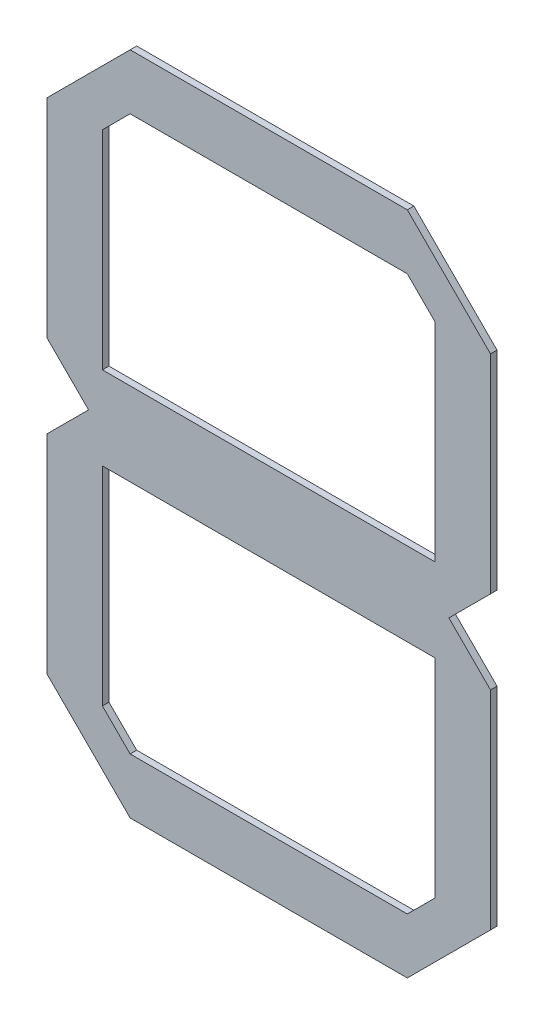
ISO-10303-21;
HEADER;
FILE_DESCRIPTION(('STEP AP214'),'2;1');
FILE_NAME('part.step','',(''),(''),'','','');
FILE_SCHEMA(('AUTOMOTIVE_DESIGN { 1 0 10303 214 1 1 1 1 }'));
ENDSEC;
DATA;
#1=APPLICATION_CONTEXT('core data for automotive mechanical design processes');
#2=APPLICATION_PROTOCOL_DEFINITION('international standard','automotive_design',2000,#1);
#3=PRODUCT_CONTEXT('',#1,'mechanical');
#4=PRODUCT('Part','Part','',(#3));
#5=PRODUCT_RELATED_PRODUCT_CATEGORY('part','',(#4));
#6=PRODUCT_DEFINITION_FORMATION('','',#4);
#7=PRODUCT_DEFINITION_CONTEXT('part definition',#1,'design');
#8=PRODUCT_DEFINITION('design','',#6,#7);
#9=PRODUCT_DEFINITION_SHAPE('','',#8);
#10=(LENGTH_UNIT() NAMED_UNIT(*) SI_UNIT(.MILLI.,.METRE.));
#11=(NAMED_UNIT(*) PLANE_ANGLE_UNIT() SI_UNIT($,.RADIAN.));
#12=(NAMED_UNIT(*) SI_UNIT($,.STERADIAN.) SOLID_ANGLE_UNIT());
#13=UNCERTAINTY_MEASURE_WITH_UNIT(LENGTH_MEASURE(1.E-05),#10,'distance_accuracy_value','');
#14=(GEOMETRIC_REPRESENTATION_CONTEXT(3) GLOBAL_UNCERTAINTY_ASSIGNED_CONTEXT((#13)) GLOBAL_UNIT_ASSIGNED_CONTEXT((#10,
#11,#12)) REPRESENTATION_CONTEXT('',''));
#15=CARTESIAN_POINT('',(0.,0.,0.));
#16=DIRECTION('',(0.,0.,1.));
#17=DIRECTION('',(1.,0.,0.));
#18=AXIS2_PLACEMENT_3D('',#15,#16,#17);
#19=CARTESIAN_POINT('',(203.2,228.6,-6.));
#20=DIRECTION('',(0.707106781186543,0.707106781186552,0.));
#21=DIRECTION('',(-0.707106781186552,0.707106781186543,0.));
#22=AXIS2_PLACEMENT_3D('',#19,#20,#21);
#23=PLANE('',#22);
#24=DIRECTION('',(-0.707106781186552,0.707106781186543,0.));
#25=VECTOR('',#24,1.);
#26=CARTESIAN_POINT('',(203.2,228.6,0.));
#27=LINE('',#26,#25);
#28=CARTESIAN_POINT('',(203.2,228.6,0.));
#29=VERTEX_POINT('',#28);
#30=CARTESIAN_POINT('',(126.999999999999,304.8,0.));
#31=VERTEX_POINT('',#30);
#32=EDGE_CURVE('E297',#29,#31,#27,.T.);
#33=ORIENTED_EDGE('',*,*,#32,.F.);
#34=DIRECTION('',(0.,0.,1.));
#35=VECTOR('',#34,1.);
#36=CARTESIAN_POINT('',(203.2,228.6,-6.));
#37=LINE('',#36,#35);
#38=CARTESIAN_POINT('',(203.2,228.6,-6.));
#39=VERTEX_POINT('',#38);
#40=EDGE_CURVE('E11',#39,#29,#37,.T.);
#41=ORIENTED_EDGE('',*,*,#40,.F.);
#42=DIRECTION('',(-0.707106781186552,0.707106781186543,0.));
#43=VECTOR('',#42,1.);
#44=CARTESIAN_POINT('',(203.2,228.6,-6.));
#45=LINE('',#44,#43);
#46=CARTESIAN_POINT('',(126.999999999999,304.8,-6.));
#47=VERTEX_POINT('',#46);
#48=EDGE_CURVE('E307',#39,#47,#45,.T.);
#49=ORIENTED_EDGE('',*,*,#48,.T.);
#50=DIRECTION('',(0.,0.,1.));
#51=VECTOR('',#50,1.);
#52=CARTESIAN_POINT('',(126.999999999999,304.8,-6.));
#53=LINE('',#52,#51);
#54=EDGE_CURVE('E36',#47,#31,#53,.T.);
#55=ORIENTED_EDGE('',*,*,#54,.T.);
#56=EDGE_LOOP('',(#33,#41,#49,#55));
#57=FACE_BOUND('',#56,.T.);
#58=ADVANCED_FACE('F33',(#57),#23,.T.);
#59=CARTESIAN_POINT('',(203.2,228.6,-6.));
#60=DIRECTION('',(1.,0.,0.));
#61=DIRECTION('',(0.,1.,0.));
#62=AXIS2_PLACEMENT_3D('',#59,#60,#61);
#63=PLANE('',#62);
#64=DIRECTION('',(0.,1.,0.));
#65=VECTOR('',#64,1.);
#66=CARTESIAN_POINT('',(203.2,228.6,0.));
#67=LINE('',#66,#65);
#68=CARTESIAN_POINT('',(203.2,38.1000000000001,0.));
#69=VERTEX_POINT('',#68);
#70=EDGE_CURVE('E311',#69,#29,#67,.T.);
#71=ORIENTED_EDGE('',*,*,#70,.F.);
#72=DIRECTION('',(0.,0.,1.));
#73=VECTOR('',#72,1.);
#74=CARTESIAN_POINT('',(203.2,38.1000000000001,-6.));
#75=LINE('',#74,#73);
#76=CARTESIAN_POINT('',(203.2,38.1000000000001,-6.));
#77=VERTEX_POINT('',#76);
#78=EDGE_CURVE('E41',#77,#69,#75,.T.);
#79=ORIENTED_EDGE('',*,*,#78,.F.);
#80=DIRECTION('',(0.,1.,0.));
#81=VECTOR('',#80,1.);
#82=CARTESIAN_POINT('',(203.2,228.6,-6.));
#83=LINE('',#82,#81);
#84=EDGE_CURVE('E347',#77,#39,#83,.T.);
#85=ORIENTED_EDGE('',*,*,#84,.T.);
#86=ORIENTED_EDGE('',*,*,#40,.T.);
#87=EDGE_LOOP('',(#71,#79,#85,#86));
#88=FACE_BOUND('',#87,.T.);
#89=ADVANCED_FACE('F424',(#88),#63,.T.);
#90=CARTESIAN_POINT('',(165.1,2.22044604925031E-13,-6.));
#91=DIRECTION('',(0.707106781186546,-0.707106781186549,0.));
#92=DIRECTION('',(0.707106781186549,0.707106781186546,0.));
#93=AXIS2_PLACEMENT_3D('',#90,#91,#92);
#94=PLANE('',#93);
#95=DIRECTION('',(0.707106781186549,0.707106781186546,0.));
#96=VECTOR('',#95,1.);
#97=CARTESIAN_POINT('',(165.1,2.22044604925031E-13,0.));
#98=LINE('',#97,#96);
#99=CARTESIAN_POINT('',(165.1,2.22044604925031E-13,0.));
#100=VERTEX_POINT('',#99);
#101=EDGE_CURVE('E385',#100,#69,#98,.T.);
#102=ORIENTED_EDGE('',*,*,#101,.F.);
#103=DIRECTION('',(0.,0.,1.));
#104=VECTOR('',#103,1.);
#105=CARTESIAN_POINT('',(165.1,2.22044604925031E-13,-6.));
#106=LINE('',#105,#104);
#107=CARTESIAN_POINT('',(165.1,2.22044604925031E-13,-6.));
#108=VERTEX_POINT('',#107);
#109=EDGE_CURVE('E391',#108,#100,#106,.T.);
#110=ORIENTED_EDGE('',*,*,#109,.F.);
#111=DIRECTION('',(0.707106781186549,0.707106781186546,0.));
#112=VECTOR('',#111,1.);
#113=CARTESIAN_POINT('',(165.1,2.22044604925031E-13,-6.));
#114=LINE('',#113,#112);
#115=EDGE_CURVE('E344',#108,#77,#114,.T.);
#116=ORIENTED_EDGE('',*,*,#115,.T.);
#117=ORIENTED_EDGE('',*,*,#78,.T.);
#118=EDGE_LOOP('',(#102,#110,#116,#117));
#119=FACE_BOUND('',#118,.T.);
#120=ADVANCED_FACE('F468',(#119),#94,.T.);
#121=CARTESIAN_POINT('',(165.1,2.22044604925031E-13,-6.));
#122=DIRECTION('',(0.707106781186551,0.707106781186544,0.));
#123=DIRECTION('',(-0.707106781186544,0.707106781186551,0.));
#124=AXIS2_PLACEMENT_3D('',#121,#122,#123);
#125=PLANE('',#124);
#126=DIRECTION('',(-0.707106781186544,0.707106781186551,0.));
#127=VECTOR('',#126,1.);
#128=CARTESIAN_POINT('',(165.1,2.22044604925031E-13,0.));
#129=LINE('',#128,#127);
#130=CARTESIAN_POINT('',(203.2,-38.1000000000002,0.));
#131=VERTEX_POINT('',#130);
#132=EDGE_CURVE('E382',#131,#100,#129,.T.);
#133=ORIENTED_EDGE('',*,*,#132,.F.);
#134=DIRECTION('',(0.,0.,1.));
#135=VECTOR('',#134,1.);
#136=CARTESIAN_POINT('',(203.2,-38.1000000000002,-6.));
#137=LINE('',#136,#135);
#138=CARTESIAN_POINT('',(203.2,-38.1000000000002,-6.));
#139=VERTEX_POINT('',#138);
#140=EDGE_CURVE('E393',#139,#131,#137,.T.);
#141=ORIENTED_EDGE('',*,*,#140,.F.);
#142=DIRECTION('',(-0.707106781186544,0.707106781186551,0.));
#143=VECTOR('',#142,1.);
#144=CARTESIAN_POINT('',(165.1,2.22044604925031E-13,-6.));
#145=LINE('',#144,#143);
#146=EDGE_CURVE('E341',#139,#108,#145,.T.);
#147=ORIENTED_EDGE('',*,*,#146,.T.);
#148=ORIENTED_EDGE('',*,*,#109,.T.);
#149=EDGE_LOOP('',(#133,#141,#147,#148));
#150=FACE_BOUND('',#149,.T.);
#151=ADVANCED_FACE('F466',(#150),#125,.T.);
#152=CARTESIAN_POINT('',(203.2,-38.1000000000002,-6.));
#153=DIRECTION('',(1.,0.,0.));
#154=DIRECTION('',(0.,1.,0.));
#155=AXIS2_PLACEMENT_3D('',#152,#153,#154);
#156=PLANE('',#155);
#157=DIRECTION('',(0.,1.,0.));
#158=VECTOR('',#157,1.);
#159=CARTESIAN_POINT('',(203.2,-38.1000000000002,0.));
#160=LINE('',#159,#158);
#161=CARTESIAN_POINT('',(203.2,-228.6,0.));
#162=VERTEX_POINT('',#161);
#163=EDGE_CURVE('E379',#162,#131,#160,.T.);
#164=ORIENTED_EDGE('',*,*,#163,.F.);
#165=DIRECTION('',(0.,0.,1.));
#166=VECTOR('',#165,1.);
#167=CARTESIAN_POINT('',(203.2,-228.6,-6.));
#168=LINE('',#167,#166);
#169=CARTESIAN_POINT('',(203.2,-228.6,-6.));
#170=VERTEX_POINT('',#169);
#171=EDGE_CURVE('E395',#170,#162,#168,.T.);
#172=ORIENTED_EDGE('',*,*,#171,.F.);
#173=DIRECTION('',(0.,1.,0.));
#174=VECTOR('',#173,1.);
#175=CARTESIAN_POINT('',(203.2,-38.1000000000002,-6.));
#176=LINE('',#175,#174);
#177=EDGE_CURVE('E338',#170,#139,#176,.T.);
#178=ORIENTED_EDGE('',*,*,#177,.T.);
#179=ORIENTED_EDGE('',*,*,#140,.T.);
#180=EDGE_LOOP('',(#164,#172,#178,#179));
#181=FACE_BOUND('',#180,.T.);
#182=ADVANCED_FACE('F462',(#181),#156,.T.);
#183=CARTESIAN_POINT('',(203.2,-228.6,-6.));
#184=DIRECTION('',(0.707106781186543,-0.707106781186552,0.));
#185=DIRECTION('',(0.707106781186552,0.707106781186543,0.));
#186=AXIS2_PLACEMENT_3D('',#183,#184,#185);
#187=PLANE('',#186);
#188=DIRECTION('',(0.707106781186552,0.707106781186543,0.));
#189=VECTOR('',#188,1.);
#190=CARTESIAN_POINT('',(203.2,-228.6,0.));
#191=LINE('',#190,#189);
#192=CARTESIAN_POINT('',(126.999999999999,-304.8,0.));
#193=VERTEX_POINT('',#192);
#194=EDGE_CURVE('E376',#193,#162,#191,.T.);
#195=ORIENTED_EDGE('',*,*,#194,.F.);
#196=DIRECTION('',(0.,0.,1.));
#197=VECTOR('',#196,1.);
#198=CARTESIAN_POINT('',(126.999999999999,-304.8,-6.));
#199=LINE('',#198,#197);
#200=CARTESIAN_POINT('',(126.999999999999,-304.8,-6.));
#201=VERTEX_POINT('',#200);
#202=EDGE_CURVE('E397',#201,#193,#199,.T.);
#203=ORIENTED_EDGE('',*,*,#202,.F.);
#204=DIRECTION('',(0.707106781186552,0.707106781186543,0.));
#205=VECTOR('',#204,1.);
#206=CARTESIAN_POINT('',(203.2,-228.6,-6.));
#207=LINE('',#206,#205);
#208=EDGE_CURVE('E335',#201,#170,#207,.T.);
#209=ORIENTED_EDGE('',*,*,#208,.T.);
#210=ORIENTED_EDGE('',*,*,#171,.T.);
#211=EDGE_LOOP('',(#195,#203,#209,#210));
#212=FACE_BOUND('',#211,.T.);
#213=ADVANCED_FACE('F458',(#212),#187,.T.);
#214=CARTESIAN_POINT('',(126.999999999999,-304.8,-6.));
#215=DIRECTION('',(0.,-1.,0.));
#216=DIRECTION('',(1.,0.,0.));
#217=AXIS2_PLACEMENT_3D('',#214,#215,#216);
#218=PLANE('',#217);
#219=DIRECTION('',(1.,0.,0.));
#220=VECTOR('',#219,1.);
#221=CARTESIAN_POINT('',(126.999999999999,-304.8,0.));
#222=LINE('',#221,#220);
#223=CARTESIAN_POINT('',(-126.999999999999,-304.8,0.));
#224=VERTEX_POINT('',#223);
#225=EDGE_CURVE('E373',#224,#193,#222,.T.);
#226=ORIENTED_EDGE('',*,*,#225,.F.);
#227=DIRECTION('',(0.,0.,1.));
#228=VECTOR('',#227,1.);
#229=CARTESIAN_POINT('',(-126.999999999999,-304.8,-6.));
#230=LINE('',#229,#228);
#231=CARTESIAN_POINT('',(-126.999999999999,-304.8,-6.));
#232=VERTEX_POINT('',#231);
#233=EDGE_CURVE('E399',#232,#224,#230,.T.);
#234=ORIENTED_EDGE('',*,*,#233,.F.);
#235=DIRECTION('',(1.,0.,0.));
#236=VECTOR('',#235,1.);
#237=CARTESIAN_POINT('',(126.999999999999,-304.8,-6.));
#238=LINE('',#237,#236);
#239=EDGE_CURVE('E332',#232,#201,#238,.T.);
#240=ORIENTED_EDGE('',*,*,#239,.T.);
#241=ORIENTED_EDGE('',*,*,#202,.T.);
#242=EDGE_LOOP('',(#226,#234,#240,#241));
#243=FACE_BOUND('',#242,.T.);
#244=ADVANCED_FACE('F454',(#243),#218,.T.);
#245=CARTESIAN_POINT('',(-203.2,-228.6,-6.));
#246=DIRECTION('',(-0.707106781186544,-0.707106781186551,0.));
#247=DIRECTION('',(0.707106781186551,-0.707106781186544,0.));
#248=AXIS2_PLACEMENT_3D('',#245,#246,#247);
#249=PLANE('',#248);
#250=DIRECTION('',(0.707106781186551,-0.707106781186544,0.));
#251=VECTOR('',#250,1.);
#252=CARTESIAN_POINT('',(-203.2,-228.6,0.));
#253=LINE('',#252,#251);
#254=CARTESIAN_POINT('',(-203.2,-228.6,0.));
#255=VERTEX_POINT('',#254);
#256=EDGE_CURVE('E370',#255,#224,#253,.T.);
#257=ORIENTED_EDGE('',*,*,#256,.F.);
#258=DIRECTION('',(0.,0.,1.));
#259=VECTOR('',#258,1.);
#260=CARTESIAN_POINT('',(-203.2,-228.6,-6.));
#261=LINE('',#260,#259);
#262=CARTESIAN_POINT('',(-203.2,-228.6,-6.));
#263=VERTEX_POINT('',#262);
#264=EDGE_CURVE('E401',#263,#255,#261,.T.);
#265=ORIENTED_EDGE('',*,*,#264,.F.);
#266=DIRECTION('',(0.707106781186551,-0.707106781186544,0.));
#267=VECTOR('',#266,1.);
#268=CARTESIAN_POINT('',(-203.2,-228.6,-6.));
#269=LINE('',#268,#267);
#270=EDGE_CURVE('E329',#263,#232,#269,.T.);
#271=ORIENTED_EDGE('',*,*,#270,.T.);
#272=ORIENTED_EDGE('',*,*,#233,.T.);
#273=EDGE_LOOP('',(#257,#265,#271,#272));
#274=FACE_BOUND('',#273,.T.);
#275=ADVANCED_FACE('F450',(#274),#249,.T.);
#276=CARTESIAN_POINT('',(-203.2,-228.6,-6.));
#277=DIRECTION('',(-1.,0.,0.));
#278=DIRECTION('',(0.,-1.,0.));
#279=AXIS2_PLACEMENT_3D('',#276,#277,#278);
#280=PLANE('',#279);
#281=DIRECTION('',(0.,-1.,0.));
#282=VECTOR('',#281,1.);
#283=CARTESIAN_POINT('',(-203.2,-228.6,0.));
#284=LINE('',#283,#282);
#285=CARTESIAN_POINT('',(-203.2,-38.1000000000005,0.));
#286=VERTEX_POINT('',#285);
#287=EDGE_CURVE('E367',#286,#255,#284,.T.);
#288=ORIENTED_EDGE('',*,*,#287,.F.);
#289=DIRECTION('',(0.,0.,1.));
#290=VECTOR('',#289,1.);
#291=CARTESIAN_POINT('',(-203.2,-38.1000000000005,-6.));
#292=LINE('',#291,#290);
#293=CARTESIAN_POINT('',(-203.2,-38.1000000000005,-6.));
#294=VERTEX_POINT('',#293);
#295=EDGE_CURVE('E403',#294,#286,#292,.T.);
#296=ORIENTED_EDGE('',*,*,#295,.F.);
#297=DIRECTION('',(0.,-1.,0.));
#298=VECTOR('',#297,1.);
#299=CARTESIAN_POINT('',(-203.2,-228.6,-6.));
#300=LINE('',#299,#298);
#301=EDGE_CURVE('E326',#294,#263,#300,.T.);
#302=ORIENTED_EDGE('',*,*,#301,.T.);
#303=ORIENTED_EDGE('',*,*,#264,.T.);
#304=EDGE_LOOP('',(#288,#296,#302,#303));
#305=FACE_BOUND('',#304,.T.);
#306=ADVANCED_FACE('F446',(#305),#280,.T.);
#307=CARTESIAN_POINT('',(-165.1,0.,-6.));
#308=DIRECTION('',(-0.707106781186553,0.707106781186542,0.));
#309=DIRECTION('',(-0.707106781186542,-0.707106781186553,0.));
#310=AXIS2_PLACEMENT_3D('',#307,#308,#309);
#311=PLANE('',#310);
#312=DIRECTION('',(-0.707106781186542,-0.707106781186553,0.));
#313=VECTOR('',#312,1.);
#314=CARTESIAN_POINT('',(-165.1,0.,0.));
#315=LINE('',#314,#313);
#316=CARTESIAN_POINT('',(-165.1,0.,0.));
#317=VERTEX_POINT('',#316);
#318=EDGE_CURVE('E364',#317,#286,#315,.T.);
#319=ORIENTED_EDGE('',*,*,#318,.F.);
#320=DIRECTION('',(0.,0.,1.));
#321=VECTOR('',#320,1.);
#322=CARTESIAN_POINT('',(-165.1,0.,-6.));
#323=LINE('',#322,#321);
#324=CARTESIAN_POINT('',(-165.1,0.,-6.));
#325=VERTEX_POINT('',#324);
#326=EDGE_CURVE('E405',#325,#317,#323,.T.);
#327=ORIENTED_EDGE('',*,*,#326,.F.);
#328=DIRECTION('',(-0.707106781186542,-0.707106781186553,0.));
#329=VECTOR('',#328,1.);
#330=CARTESIAN_POINT('',(-165.1,0.,-6.));
#331=LINE('',#330,#329);
#332=EDGE_CURVE('E323',#325,#294,#331,.T.);
#333=ORIENTED_EDGE('',*,*,#332,.T.);
#334=ORIENTED_EDGE('',*,*,#295,.T.);
#335=EDGE_LOOP('',(#319,#327,#333,#334));
#336=FACE_BOUND('',#335,.T.);
#337=ADVANCED_FACE('F442',(#336),#311,.T.);
#338=CARTESIAN_POINT('',(-165.1,0.,-6.));
#339=DIRECTION('',(-0.707106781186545,-0.70710678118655,0.));
#340=DIRECTION('',(0.70710678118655,-0.707106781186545,0.));
#341=AXIS2_PLACEMENT_3D('',#338,#339,#340);
#342=PLANE('',#341);
#343=DIRECTION('',(0.70710678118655,-0.707106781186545,0.));
#344=VECTOR('',#343,1.);
#345=CARTESIAN_POINT('',(-165.1,0.,0.));
#346=LINE('',#345,#344);
#347=CARTESIAN_POINT('',(-203.2,38.0999999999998,0.));
#348=VERTEX_POINT('',#347);
#349=EDGE_CURVE('E361',#348,#317,#346,.T.);
#350=ORIENTED_EDGE('',*,*,#349,.F.);
#351=DIRECTION('',(0.,0.,1.));
#352=VECTOR('',#351,1.);
#353=CARTESIAN_POINT('',(-203.2,38.0999999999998,-6.));
#354=LINE('',#353,#352);
#355=CARTESIAN_POINT('',(-203.2,38.0999999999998,-6.));
#356=VERTEX_POINT('',#355);
#357=EDGE_CURVE('E407',#356,#348,#354,.T.);
#358=ORIENTED_EDGE('',*,*,#357,.F.);
#359=DIRECTION('',(0.70710678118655,-0.707106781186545,0.));
#360=VECTOR('',#359,1.);
#361=CARTESIAN_POINT('',(-165.1,0.,-6.));
#362=LINE('',#361,#360);
#363=EDGE_CURVE('E320',#356,#325,#362,.T.);
#364=ORIENTED_EDGE('',*,*,#363,.T.);
#365=ORIENTED_EDGE('',*,*,#326,.T.);
#366=EDGE_LOOP('',(#350,#358,#364,#365));
#367=FACE_BOUND('',#366,.T.);
#368=ADVANCED_FACE('F438',(#367),#342,.T.);
#369=CARTESIAN_POINT('',(-203.2,38.0999999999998,-6.));
#370=DIRECTION('',(-1.,0.,0.));
#371=DIRECTION('',(0.,-1.,0.));
#372=AXIS2_PLACEMENT_3D('',#369,#370,#371);
#373=PLANE('',#372);
#374=DIRECTION('',(0.,-1.,0.));
#375=VECTOR('',#374,1.);
#376=CARTESIAN_POINT('',(-203.2,38.0999999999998,0.));
#377=LINE('',#376,#375);
#378=CARTESIAN_POINT('',(-203.2,228.6,0.));
#379=VERTEX_POINT('',#378);
#380=EDGE_CURVE('E358',#379,#348,#377,.T.);
#381=ORIENTED_EDGE('',*,*,#380,.F.);
#382=DIRECTION('',(0.,0.,1.));
#383=VECTOR('',#382,1.);
#384=CARTESIAN_POINT('',(-203.2,228.6,-6.));
#385=LINE('',#384,#383);
#386=CARTESIAN_POINT('',(-203.2,228.6,-6.));
#387=VERTEX_POINT('',#386);
#388=EDGE_CURVE('E409',#387,#379,#385,.T.);
#389=ORIENTED_EDGE('',*,*,#388,.F.);
#390=DIRECTION('',(0.,-1.,0.));
#391=VECTOR('',#390,1.);
#392=CARTESIAN_POINT('',(-203.2,38.0999999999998,-6.));
#393=LINE('',#392,#391);
#394=EDGE_CURVE('E317',#387,#356,#393,.T.);
#395=ORIENTED_EDGE('',*,*,#394,.T.);
#396=ORIENTED_EDGE('',*,*,#357,.T.);
#397=EDGE_LOOP('',(#381,#389,#395,#396));
#398=FACE_BOUND('',#397,.T.);
#399=ADVANCED_FACE('F436',(#398),#373,.T.);
#400=CARTESIAN_POINT('',(-203.2,228.6,-6.));
#401=DIRECTION('',(-0.707106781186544,0.707106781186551,0.));
#402=DIRECTION('',(-0.707106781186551,-0.707106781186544,0.));
#403=AXIS2_PLACEMENT_3D('',#400,#401,#402);
#404=PLANE('',#403);
#405=DIRECTION('',(-0.707106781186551,-0.707106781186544,0.));
#406=VECTOR('',#405,1.);
#407=CARTESIAN_POINT('',(-203.2,228.6,0.));
#408=LINE('',#407,#406);
#409=CARTESIAN_POINT('',(-126.999999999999,304.8,0.));
#410=VERTEX_POINT('',#409);
#411=EDGE_CURVE('E355',#410,#379,#408,.T.);
#412=ORIENTED_EDGE('',*,*,#411,.F.);
#413=DIRECTION('',(0.,0.,1.));
#414=VECTOR('',#413,1.);
#415=CARTESIAN_POINT('',(-126.999999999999,304.8,-6.));
#416=LINE('',#415,#414);
#417=CARTESIAN_POINT('',(-126.999999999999,304.8,-6.));
#418=VERTEX_POINT('',#417);
#419=EDGE_CURVE('E410',#418,#410,#416,.T.);
#420=ORIENTED_EDGE('',*,*,#419,.F.);
#421=DIRECTION('',(-0.707106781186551,-0.707106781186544,0.));
#422=VECTOR('',#421,1.);
#423=CARTESIAN_POINT('',(-203.2,228.6,-6.));
#424=LINE('',#423,#422);
#425=EDGE_CURVE('E314',#418,#387,#424,.T.);
#426=ORIENTED_EDGE('',*,*,#425,.T.);
#427=ORIENTED_EDGE('',*,*,#388,.T.);
#428=EDGE_LOOP('',(#412,#420,#426,#427));
#429=FACE_BOUND('',#428,.T.);
#430=ADVANCED_FACE('F432',(#429),#404,.T.);
#431=CARTESIAN_POINT('',(-126.999999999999,304.8,-6.));
#432=DIRECTION('',(0.,1.,0.));
#433=DIRECTION('',(-1.,0.,0.));
#434=AXIS2_PLACEMENT_3D('',#431,#432,#433);
#435=PLANE('',#434);
#436=DIRECTION('',(-1.,0.,0.));
#437=VECTOR('',#436,1.);
#438=CARTESIAN_POINT('',(-126.999999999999,304.8,0.));
#439=LINE('',#438,#437);
#440=EDGE_CURVE('E352',#31,#410,#439,.T.);
#441=ORIENTED_EDGE('',*,*,#440,.F.);
#442=ORIENTED_EDGE('',*,*,#54,.F.);
#443=DIRECTION('',(-1.,0.,0.));
#444=VECTOR('',#443,1.);
#445=CARTESIAN_POINT('',(-126.999999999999,304.8,-6.));
#446=LINE('',#445,#444);
#447=EDGE_CURVE('E310',#47,#418,#446,.T.);
#448=ORIENTED_EDGE('',*,*,#447,.T.);
#449=ORIENTED_EDGE('',*,*,#419,.T.);
#450=EDGE_LOOP('',(#441,#442,#448,#449));
#451=FACE_BOUND('',#450,.T.);
#452=ADVANCED_FACE('F418',(#451),#435,.T.);
#453=CARTESIAN_POINT('',(0.,0.,-6.));
#454=DIRECTION('',(0.,0.,-1.));
#455=DIRECTION('',(-1.,0.,0.));
#456=AXIS2_PLACEMENT_3D('',#453,#454,#455);
#457=PLANE('',#456);
#458=DIRECTION('',(1.,0.,0.));
#459=VECTOR('',#458,1.);
#460=CARTESIAN_POINT('',(0.,-254.,-6.));
#461=LINE('',#460,#459);
#462=CARTESIAN_POINT('',(-126.999999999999,-254.000000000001,-6.));
#463=VERTEX_POINT('',#462);
#464=CARTESIAN_POINT('',(126.999999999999,-254.,-6.));
#465=VERTEX_POINT('',#464);
#466=EDGE_CURVE('E207',#463,#465,#461,.T.);
#467=ORIENTED_EDGE('',*,*,#466,.T.);
#468=DIRECTION('',(0.707106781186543,0.707106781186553,0.));
#469=VECTOR('',#468,1.);
#470=CARTESIAN_POINT('',(126.999999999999,-254.,-6.));
#471=LINE('',#470,#469);
#472=CARTESIAN_POINT('',(152.399999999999,-228.6,-6.));
#473=VERTEX_POINT('',#472);
#474=EDGE_CURVE('E216',#465,#473,#471,.T.);
#475=ORIENTED_EDGE('',*,*,#474,.T.);
#476=DIRECTION('',(0.,1.,0.));
#477=VECTOR('',#476,1.);
#478=CARTESIAN_POINT('',(152.399999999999,-228.6,-6.));
#479=LINE('',#478,#477);
#480=CARTESIAN_POINT('',(152.4,-38.1000000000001,-6.));
#481=VERTEX_POINT('',#480);
#482=EDGE_CURVE('E49',#473,#481,#479,.T.);
#483=ORIENTED_EDGE('',*,*,#482,.T.);
#484=DIRECTION('',(-1.,0.,0.));
#485=VECTOR('',#484,1.);
#486=CARTESIAN_POINT('',(-152.4,-38.0999999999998,-6.));
#487=LINE('',#486,#485);
#488=CARTESIAN_POINT('',(-152.4,-38.0999999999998,-6.));
#489=VERTEX_POINT('',#488);
#490=EDGE_CURVE('E230',#481,#489,#487,.T.);
#491=ORIENTED_EDGE('',*,*,#490,.T.);
#492=DIRECTION('',(0.,-1.,0.));
#493=VECTOR('',#492,1.);
#494=CARTESIAN_POINT('',(-152.4,-38.0999999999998,-6.));
#495=LINE('',#494,#493);
#496=CARTESIAN_POINT('',(-152.4,-228.6,-6.));
#497=VERTEX_POINT('',#496);
#498=EDGE_CURVE('E233',#489,#497,#495,.T.);
#499=ORIENTED_EDGE('',*,*,#498,.T.);
#500=DIRECTION('',(0.707106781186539,-0.707106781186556,0.));
#501=VECTOR('',#500,1.);
#502=CARTESIAN_POINT('',(-152.4,-228.6,-6.));
#503=LINE('',#502,#501);
#504=EDGE_CURVE('E213',#497,#463,#503,.T.);
#505=ORIENTED_EDGE('',*,*,#504,.T.);
#506=EDGE_LOOP('',(#467,#475,#483,#491,#499,#505));
#507=FACE_BOUND('',#506,.T.);
#508=DIRECTION('',(-0.707106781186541,0.707106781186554,0.));
#509=VECTOR('',#508,1.);
#510=CARTESIAN_POINT('',(126.999999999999,254.,-6.));
#511=LINE('',#510,#509);
#512=CARTESIAN_POINT('',(152.399999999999,228.6,-6.));
#513=VERTEX_POINT('',#512);
#514=CARTESIAN_POINT('',(126.999999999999,254.,-6.));
#515=VERTEX_POINT('',#514);
#516=EDGE_CURVE('E275',#513,#515,#511,.T.);
#517=ORIENTED_EDGE('',*,*,#516,.T.);
#518=DIRECTION('',(-1.,0.,0.));
#519=VECTOR('',#518,1.);
#520=CARTESIAN_POINT('',(0.,254.,-6.));
#521=LINE('',#520,#519);
#522=CARTESIAN_POINT('',(-126.999999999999,254.000000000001,-6.));
#523=VERTEX_POINT('',#522);
#524=EDGE_CURVE('E259',#515,#523,#521,.T.);
#525=ORIENTED_EDGE('',*,*,#524,.T.);
#526=DIRECTION('',(-0.707106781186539,-0.707106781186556,0.));
#527=VECTOR('',#526,1.);
#528=CARTESIAN_POINT('',(-152.4,228.6,-6.));
#529=LINE('',#528,#527);
#530=CARTESIAN_POINT('',(-152.4,228.6,-6.));
#531=VERTEX_POINT('',#530);
#532=EDGE_CURVE('E262',#523,#531,#529,.T.);
#533=ORIENTED_EDGE('',*,*,#532,.T.);
#534=DIRECTION('',(0.,-1.,0.));
#535=VECTOR('',#534,1.);
#536=CARTESIAN_POINT('',(-152.4,38.0999999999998,-6.));
#537=LINE('',#536,#535);
#538=CARTESIAN_POINT('',(-152.4,38.0999999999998,-6.));
#539=VERTEX_POINT('',#538);
#540=EDGE_CURVE('E266',#531,#539,#537,.T.);
#541=ORIENTED_EDGE('',*,*,#540,.T.);
#542=DIRECTION('',(1.,0.,0.));
#543=VECTOR('',#542,1.);
#544=CARTESIAN_POINT('',(-152.4,38.0999999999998,-6.));
#545=LINE('',#544,#543);
#546=CARTESIAN_POINT('',(152.4,38.1000000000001,-6.));
#547=VERTEX_POINT('',#546);
#548=EDGE_CURVE('E269',#539,#547,#545,.T.);
#549=ORIENTED_EDGE('',*,*,#548,.T.);
#550=DIRECTION('',(0.,1.,0.));
#551=VECTOR('',#550,1.);
#552=CARTESIAN_POINT('',(152.399999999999,228.6,-6.));
#553=LINE('',#552,#551);
#554=EDGE_CURVE('E272',#547,#513,#553,.T.);
#555=ORIENTED_EDGE('',*,*,#554,.T.);
#556=EDGE_LOOP('',(#517,#525,#533,#541,#549,#555));
#557=FACE_BOUND('',#556,.T.);
#558=ORIENTED_EDGE('',*,*,#48,.F.);
#559=ORIENTED_EDGE('',*,*,#84,.F.);
#560=ORIENTED_EDGE('',*,*,#115,.F.);
#561=ORIENTED_EDGE('',*,*,#146,.F.);
#562=ORIENTED_EDGE('',*,*,#177,.F.);
#563=ORIENTED_EDGE('',*,*,#208,.F.);
#564=ORIENTED_EDGE('',*,*,#239,.F.);
#565=ORIENTED_EDGE('',*,*,#270,.F.);
#566=ORIENTED_EDGE('',*,*,#301,.F.);
#567=ORIENTED_EDGE('',*,*,#332,.F.);
#568=ORIENTED_EDGE('',*,*,#363,.F.);
#569=ORIENTED_EDGE('',*,*,#394,.F.);
#570=ORIENTED_EDGE('',*,*,#425,.F.);
#571=ORIENTED_EDGE('',*,*,#447,.F.);
#572=EDGE_LOOP('',(#558,#559,#560,#561,#562,#563,#564,#565,#566,#567,#568,#569,#570,#571));
#573=FACE_BOUND('',#572,.T.);
#574=ADVANCED_FACE('F221',(#507,#557,#573),#457,.T.);
#575=CARTESIAN_POINT('',(0.,0.,0.));
#576=DIRECTION('',(0.,0.,-1.));
#577=DIRECTION('',(-1.,0.,0.));
#578=AXIS2_PLACEMENT_3D('',#575,#576,#577);
#579=PLANE('',#578);
#580=DIRECTION('',(0.707106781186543,0.707106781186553,0.));
#581=VECTOR('',#580,1.);
#582=CARTESIAN_POINT('',(126.999999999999,-254.,0.));
#583=LINE('',#582,#581);
#584=CARTESIAN_POINT('',(126.999999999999,-254.,0.));
#585=VERTEX_POINT('',#584);
#586=CARTESIAN_POINT('',(152.399999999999,-228.6,0.));
#587=VERTEX_POINT('',#586);
#588=EDGE_CURVE('E236',#585,#587,#583,.T.);
#589=ORIENTED_EDGE('',*,*,#588,.F.);
#590=DIRECTION('',(1.,0.,0.));
#591=VECTOR('',#590,1.);
#592=CARTESIAN_POINT('',(-126.999999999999,-254.000000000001,0.));
#593=LINE('',#592,#591);
#594=CARTESIAN_POINT('',(-126.999999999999,-254.000000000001,0.));
#595=VERTEX_POINT('',#594);
#596=EDGE_CURVE('E210',#595,#585,#593,.T.);
#597=ORIENTED_EDGE('',*,*,#596,.F.);
#598=DIRECTION('',(0.707106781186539,-0.707106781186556,0.));
#599=VECTOR('',#598,1.);
#600=CARTESIAN_POINT('',(-152.4,-228.6,0.));
#601=LINE('',#600,#599);
#602=CARTESIAN_POINT('',(-152.4,-228.6,0.));
#603=VERTEX_POINT('',#602);
#604=EDGE_CURVE('E226',#603,#595,#601,.T.);
#605=ORIENTED_EDGE('',*,*,#604,.F.);
#606=DIRECTION('',(0.,-1.,0.));
#607=VECTOR('',#606,1.);
#608=CARTESIAN_POINT('',(-152.4,-38.0999999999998,0.));
#609=LINE('',#608,#607);
#610=CARTESIAN_POINT('',(-152.4,-38.0999999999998,0.));
#611=VERTEX_POINT('',#610);
#612=EDGE_CURVE('E244',#611,#603,#609,.T.);
#613=ORIENTED_EDGE('',*,*,#612,.F.);
#614=DIRECTION('',(-1.,0.,0.));
#615=VECTOR('',#614,1.);
#616=CARTESIAN_POINT('',(-152.4,-38.0999999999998,0.));
#617=LINE('',#616,#615);
#618=CARTESIAN_POINT('',(152.4,-38.1000000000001,0.));
#619=VERTEX_POINT('',#618);
#620=EDGE_CURVE('E241',#619,#611,#617,.T.);
#621=ORIENTED_EDGE('',*,*,#620,.F.);
#622=DIRECTION('',(0.,1.,0.));
#623=VECTOR('',#622,1.);
#624=CARTESIAN_POINT('',(152.399999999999,-228.6,0.));
#625=LINE('',#624,#623);
#626=EDGE_CURVE('E238',#587,#619,#625,.T.);
#627=ORIENTED_EDGE('',*,*,#626,.F.);
#628=EDGE_LOOP('',(#589,#597,#605,#613,#621,#627));
#629=FACE_BOUND('',#628,.T.);
#630=DIRECTION('',(-1.,0.,0.));
#631=VECTOR('',#630,1.);
#632=CARTESIAN_POINT('',(-126.999999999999,254.000000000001,0.));
#633=LINE('',#632,#631);
#634=CARTESIAN_POINT('',(126.999999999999,253.999999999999,0.));
#635=VERTEX_POINT('',#634);
#636=CARTESIAN_POINT('',(-126.999999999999,254.000000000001,0.));
#637=VERTEX_POINT('',#636);
#638=EDGE_CURVE('E251',#635,#637,#633,.T.);
#639=ORIENTED_EDGE('',*,*,#638,.F.);
#640=DIRECTION('',(-0.707106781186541,0.707106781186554,0.));
#641=VECTOR('',#640,1.);
#642=CARTESIAN_POINT('',(126.999999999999,254.,0.));
#643=LINE('',#642,#641);
#644=CARTESIAN_POINT('',(152.399999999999,228.6,0.));
#645=VERTEX_POINT('',#644);
#646=EDGE_CURVE('E263',#645,#635,#643,.T.);
#647=ORIENTED_EDGE('',*,*,#646,.F.);
#648=DIRECTION('',(0.,1.,0.));
#649=VECTOR('',#648,1.);
#650=CARTESIAN_POINT('',(152.399999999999,228.6,0.));
#651=LINE('',#650,#649);
#652=CARTESIAN_POINT('',(152.4,38.1000000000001,0.));
#653=VERTEX_POINT('',#652);
#654=EDGE_CURVE('E290',#653,#645,#651,.T.);
#655=ORIENTED_EDGE('',*,*,#654,.F.);
#656=DIRECTION('',(1.,0.,0.));
#657=VECTOR('',#656,1.);
#658=CARTESIAN_POINT('',(-152.4,38.0999999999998,0.));
#659=LINE('',#658,#657);
#660=CARTESIAN_POINT('',(-152.4,38.0999999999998,0.));
#661=VERTEX_POINT('',#660);
#662=EDGE_CURVE('E287',#661,#653,#659,.T.);
#663=ORIENTED_EDGE('',*,*,#662,.F.);
#664=DIRECTION('',(0.,-1.,0.));
#665=VECTOR('',#664,1.);
#666=CARTESIAN_POINT('',(-152.4,38.0999999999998,0.));
#667=LINE('',#666,#665);
#668=CARTESIAN_POINT('',(-152.4,228.6,0.));
#669=VERTEX_POINT('',#668);
#670=EDGE_CURVE('E284',#669,#661,#667,.T.);
#671=ORIENTED_EDGE('',*,*,#670,.F.);
#672=DIRECTION('',(-0.707106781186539,-0.707106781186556,0.));
#673=VECTOR('',#672,1.);
#674=CARTESIAN_POINT('',(-152.4,228.6,0.));
#675=LINE('',#674,#673);
#676=EDGE_CURVE('E281',#637,#669,#675,.T.);
#677=ORIENTED_EDGE('',*,*,#676,.F.);
#678=EDGE_LOOP('',(#639,#647,#655,#663,#671,#677));
#679=FACE_BOUND('',#678,.T.);
#680=ORIENTED_EDGE('',*,*,#32,.T.);
#681=ORIENTED_EDGE('',*,*,#440,.T.);
#682=ORIENTED_EDGE('',*,*,#411,.T.);
#683=ORIENTED_EDGE('',*,*,#380,.T.);
#684=ORIENTED_EDGE('',*,*,#349,.T.);
#685=ORIENTED_EDGE('',*,*,#318,.T.);
#686=ORIENTED_EDGE('',*,*,#287,.T.);
#687=ORIENTED_EDGE('',*,*,#256,.T.);
#688=ORIENTED_EDGE('',*,*,#225,.T.);
#689=ORIENTED_EDGE('',*,*,#194,.T.);
#690=ORIENTED_EDGE('',*,*,#163,.T.);
#691=ORIENTED_EDGE('',*,*,#132,.T.);
#692=ORIENTED_EDGE('',*,*,#101,.T.);
#693=ORIENTED_EDGE('',*,*,#70,.T.);
#694=EDGE_LOOP('',(#680,#681,#682,#683,#684,#685,#686,#687,#688,#689,#690,#691,#692,#693));
#695=FACE_BOUND('',#694,.T.);
#696=ADVANCED_FACE('F420',(#629,#679,#695),#579,.F.);
#697=CARTESIAN_POINT('',(126.999999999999,254.,-6.));
#698=DIRECTION('',(0.707106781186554,0.707106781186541,0.));
#699=DIRECTION('',(-0.707106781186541,0.707106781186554,0.));
#700=AXIS2_PLACEMENT_3D('',#697,#698,#699);
#701=PLANE('',#700);
#702=ORIENTED_EDGE('',*,*,#646,.T.);
#703=DIRECTION('',(0.,0.,1.));
#704=VECTOR('',#703,1.);
#705=CARTESIAN_POINT('',(126.999999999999,254.,-6.));
#706=LINE('',#705,#704);
#707=EDGE_CURVE('E294',#515,#635,#706,.T.);
#708=ORIENTED_EDGE('',*,*,#707,.F.);
#709=ORIENTED_EDGE('',*,*,#516,.F.);
#710=DIRECTION('',(0.,0.,1.));
#711=VECTOR('',#710,1.);
#712=CARTESIAN_POINT('',(152.399999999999,228.6,-6.));
#713=LINE('',#712,#711);
#714=EDGE_CURVE('E298',#513,#645,#713,.T.);
#715=ORIENTED_EDGE('',*,*,#714,.T.);
#716=EDGE_LOOP('',(#702,#708,#709,#715));
#717=FACE_BOUND('',#716,.T.);
#718=ADVANCED_FACE('F590',(#717),#701,.F.);
#719=CARTESIAN_POINT('',(152.399999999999,228.6,-6.));
#720=DIRECTION('',(1.,0.,0.));
#721=DIRECTION('',(0.,1.,0.));
#722=AXIS2_PLACEMENT_3D('',#719,#720,#721);
#723=PLANE('',#722);
#724=ORIENTED_EDGE('',*,*,#654,.T.);
#725=ORIENTED_EDGE('',*,*,#714,.F.);
#726=ORIENTED_EDGE('',*,*,#554,.F.);
#727=DIRECTION('',(0.,0.,1.));
#728=VECTOR('',#727,1.);
#729=CARTESIAN_POINT('',(152.4,38.1000000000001,-6.));
#730=LINE('',#729,#728);
#731=EDGE_CURVE('E300',#547,#653,#730,.T.);
#732=ORIENTED_EDGE('',*,*,#731,.T.);
#733=EDGE_LOOP('',(#724,#725,#726,#732));
#734=FACE_BOUND('',#733,.T.);
#735=ADVANCED_FACE('F600',(#734),#723,.F.);
#736=CARTESIAN_POINT('',(-152.4,38.0999999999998,-6.));
#737=DIRECTION('',(0.,-1.,0.));
#738=DIRECTION('',(1.,0.,0.));
#739=AXIS2_PLACEMENT_3D('',#736,#737,#738);
#740=PLANE('',#739);
#741=ORIENTED_EDGE('',*,*,#662,.T.);
#742=ORIENTED_EDGE('',*,*,#731,.F.);
#743=ORIENTED_EDGE('',*,*,#548,.F.);
#744=DIRECTION('',(0.,0.,1.));
#745=VECTOR('',#744,1.);
#746=CARTESIAN_POINT('',(-152.4,38.0999999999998,-6.));
#747=LINE('',#746,#745);
#748=EDGE_CURVE('E302',#539,#661,#747,.T.);
#749=ORIENTED_EDGE('',*,*,#748,.T.);
#750=EDGE_LOOP('',(#741,#742,#743,#749));
#751=FACE_BOUND('',#750,.T.);
#752=ADVANCED_FACE('F610',(#751),#740,.F.);
#753=CARTESIAN_POINT('',(-152.4,38.0999999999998,-6.));
#754=DIRECTION('',(-1.,0.,0.));
#755=DIRECTION('',(0.,0.,1.));
#756=AXIS2_PLACEMENT_3D('',#753,#754,#755);
#757=PLANE('',#756);
#758=ORIENTED_EDGE('',*,*,#670,.T.);
#759=ORIENTED_EDGE('',*,*,#748,.F.);
#760=ORIENTED_EDGE('',*,*,#540,.F.);
#761=DIRECTION('',(0.,0.,1.));
#762=VECTOR('',#761,1.);
#763=CARTESIAN_POINT('',(-152.4,228.6,-6.));
#764=LINE('',#763,#762);
#765=EDGE_CURVE('E304',#531,#669,#764,.T.);
#766=ORIENTED_EDGE('',*,*,#765,.T.);
#767=EDGE_LOOP('',(#758,#759,#760,#766));
#768=FACE_BOUND('',#767,.T.);
#769=ADVANCED_FACE('F620',(#768),#757,.F.);
#770=CARTESIAN_POINT('',(-152.4,228.6,-6.));
#771=DIRECTION('',(-0.707106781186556,0.707106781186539,0.));
#772=DIRECTION('',(-0.707106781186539,-0.707106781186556,0.));
#773=AXIS2_PLACEMENT_3D('',#770,#771,#772);
#774=PLANE('',#773);
#775=ORIENTED_EDGE('',*,*,#676,.T.);
#776=ORIENTED_EDGE('',*,*,#765,.F.);
#777=ORIENTED_EDGE('',*,*,#532,.F.);
#778=DIRECTION('',(0.,0.,1.));
#779=VECTOR('',#778,1.);
#780=CARTESIAN_POINT('',(-126.999999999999,254.000000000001,-6.));
#781=LINE('',#780,#779);
#782=EDGE_CURVE('E278',#523,#637,#781,.T.);
#783=ORIENTED_EDGE('',*,*,#782,.T.);
#784=EDGE_LOOP('',(#775,#776,#777,#783));
#785=FACE_BOUND('',#784,.T.);
#786=ADVANCED_FACE('F630',(#785),#774,.F.);
#787=CARTESIAN_POINT('',(-126.999999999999,254.000000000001,-6.));
#788=DIRECTION('',(0.,1.,0.));
#789=DIRECTION('',(-1.,0.,0.));
#790=AXIS2_PLACEMENT_3D('',#787,#788,#789);
#791=PLANE('',#790);
#792=ORIENTED_EDGE('',*,*,#638,.T.);
#793=ORIENTED_EDGE('',*,*,#782,.F.);
#794=ORIENTED_EDGE('',*,*,#524,.F.);
#795=ORIENTED_EDGE('',*,*,#707,.T.);
#796=EDGE_LOOP('',(#792,#793,#794,#795));
#797=FACE_BOUND('',#796,.T.);
#798=ADVANCED_FACE('F640',(#797),#791,.F.);
#799=CARTESIAN_POINT('',(-126.999999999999,-254.000000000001,-6.));
#800=DIRECTION('',(0.,-1.,0.));
#801=DIRECTION('',(1.,0.,0.));
#802=AXIS2_PLACEMENT_3D('',#799,#800,#801);
#803=PLANE('',#802);
#804=ORIENTED_EDGE('',*,*,#596,.T.);
#805=DIRECTION('',(0.,0.,1.));
#806=VECTOR('',#805,1.);
#807=CARTESIAN_POINT('',(126.999999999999,-254.,-6.));
#808=LINE('',#807,#806);
#809=EDGE_CURVE('E57',#465,#585,#808,.T.);
#810=ORIENTED_EDGE('',*,*,#809,.F.);
#811=ORIENTED_EDGE('',*,*,#466,.F.);
#812=DIRECTION('',(0.,0.,1.));
#813=VECTOR('',#812,1.);
#814=CARTESIAN_POINT('',(-126.999999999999,-254.000000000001,-6.));
#815=LINE('',#814,#813);
#816=EDGE_CURVE('E249',#463,#595,#815,.T.);
#817=ORIENTED_EDGE('',*,*,#816,.T.);
#818=EDGE_LOOP('',(#804,#810,#811,#817));
#819=FACE_BOUND('',#818,.T.);
#820=ADVANCED_FACE('F205',(#819),#803,.F.);
#821=CARTESIAN_POINT('',(-152.4,-228.6,-6.));
#822=DIRECTION('',(-0.707106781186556,-0.707106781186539,0.));
#823=DIRECTION('',(0.707106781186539,-0.707106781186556,0.));
#824=AXIS2_PLACEMENT_3D('',#821,#822,#823);
#825=PLANE('',#824);
#826=ORIENTED_EDGE('',*,*,#604,.T.);
#827=ORIENTED_EDGE('',*,*,#816,.F.);
#828=ORIENTED_EDGE('',*,*,#504,.F.);
#829=DIRECTION('',(0.,0.,1.));
#830=VECTOR('',#829,1.);
#831=CARTESIAN_POINT('',(-152.4,-228.6,-6.));
#832=LINE('',#831,#830);
#833=EDGE_CURVE('E252',#497,#603,#832,.T.);
#834=ORIENTED_EDGE('',*,*,#833,.T.);
#835=EDGE_LOOP('',(#826,#827,#828,#834));
#836=FACE_BOUND('',#835,.T.);
#837=ADVANCED_FACE('F661',(#836),#825,.F.);
#838=CARTESIAN_POINT('',(-152.4,-38.0999999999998,-6.));
#839=DIRECTION('',(-1.,0.,0.));
#840=DIRECTION('',(0.,0.,1.));
#841=AXIS2_PLACEMENT_3D('',#838,#839,#840);
#842=PLANE('',#841);
#843=ORIENTED_EDGE('',*,*,#612,.T.);
#844=ORIENTED_EDGE('',*,*,#833,.F.);
#845=ORIENTED_EDGE('',*,*,#498,.F.);
#846=DIRECTION('',(0.,0.,1.));
#847=VECTOR('',#846,1.);
#848=CARTESIAN_POINT('',(-152.4,-38.0999999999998,-6.));
#849=LINE('',#848,#847);
#850=EDGE_CURVE('E254',#489,#611,#849,.T.);
#851=ORIENTED_EDGE('',*,*,#850,.T.);
#852=EDGE_LOOP('',(#843,#844,#845,#851));
#853=FACE_BOUND('',#852,.T.);
#854=ADVANCED_FACE('F670',(#853),#842,.F.);
#855=CARTESIAN_POINT('',(-152.4,-38.0999999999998,-6.));
#856=DIRECTION('',(0.,1.,0.));
#857=DIRECTION('',(-1.,0.,0.));
#858=AXIS2_PLACEMENT_3D('',#855,#856,#857);
#859=PLANE('',#858);
#860=ORIENTED_EDGE('',*,*,#620,.T.);
#861=ORIENTED_EDGE('',*,*,#850,.F.);
#862=ORIENTED_EDGE('',*,*,#490,.F.);
#863=DIRECTION('',(0.,0.,1.));
#864=VECTOR('',#863,1.);
#865=CARTESIAN_POINT('',(152.4,-38.1000000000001,-6.));
#866=LINE('',#865,#864);
#867=EDGE_CURVE('E256',#481,#619,#866,.T.);
#868=ORIENTED_EDGE('',*,*,#867,.T.);
#869=EDGE_LOOP('',(#860,#861,#862,#868));
#870=FACE_BOUND('',#869,.T.);
#871=ADVANCED_FACE('F680',(#870),#859,.F.);
#872=CARTESIAN_POINT('',(152.399999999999,-228.6,-6.));
#873=DIRECTION('',(1.,0.,0.));
#874=DIRECTION('',(0.,1.,0.));
#875=AXIS2_PLACEMENT_3D('',#872,#873,#874);
#876=PLANE('',#875);
#877=ORIENTED_EDGE('',*,*,#626,.T.);
#878=ORIENTED_EDGE('',*,*,#867,.F.);
#879=ORIENTED_EDGE('',*,*,#482,.F.);
#880=DIRECTION('',(0.,0.,1.));
#881=VECTOR('',#880,1.);
#882=CARTESIAN_POINT('',(152.399999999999,-228.6,-6.));
#883=LINE('',#882,#881);
#884=EDGE_CURVE('E212',#473,#587,#883,.T.);
#885=ORIENTED_EDGE('',*,*,#884,.T.);
#886=EDGE_LOOP('',(#877,#878,#879,#885));
#887=FACE_BOUND('',#886,.T.);
#888=ADVANCED_FACE('F690',(#887),#876,.F.);
#889=CARTESIAN_POINT('',(126.999999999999,-254.,-6.));
#890=DIRECTION('',(0.707106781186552,-0.707106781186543,0.));
#891=DIRECTION('',(0.707106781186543,0.707106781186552,0.));
#892=AXIS2_PLACEMENT_3D('',#889,#890,#891);
#893=PLANE('',#892);
#894=ORIENTED_EDGE('',*,*,#588,.T.);
#895=ORIENTED_EDGE('',*,*,#884,.F.);
#896=ORIENTED_EDGE('',*,*,#474,.F.);
#897=ORIENTED_EDGE('',*,*,#809,.T.);
#898=EDGE_LOOP('',(#894,#895,#896,#897));
#899=FACE_BOUND('',#898,.T.);
#900=ADVANCED_FACE('F217',(#899),#893,.F.);
#901=CLOSED_SHELL('',(#58,#89,#120,#151,#182,#213,#244,#275,#306,#337,#368,#399,#430,#452,#574,
#696,#718,#735,#752,#769,#786,#798,#820,#837,#854,#871,#888,#900));
#902=MANIFOLD_SOLID_BREP('B2',#901);
#903=ADVANCED_BREP_SHAPE_REPRESENTATION('',(#18,#902),#14);
#904=SHAPE_DEFINITION_REPRESENTATION(#9,#903);
ENDSEC;
END-ISO-10303-21;
